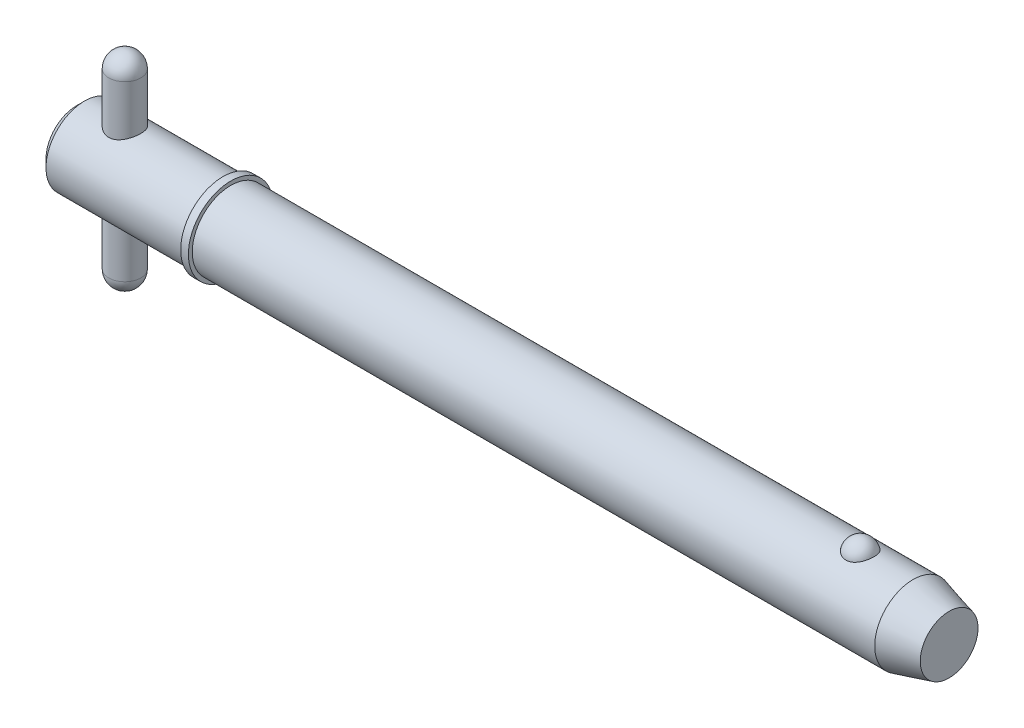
ISO-10303-21;
HEADER;
FILE_DESCRIPTION(('STEP AP214'),'2;1');
FILE_NAME('part.step','',(''),(''),'','','');
FILE_SCHEMA(('AUTOMOTIVE_DESIGN { 1 0 10303 214 1 1 1 1 }'));
ENDSEC;
DATA;
#1=APPLICATION_CONTEXT('core data for automotive mechanical design processes');
#2=APPLICATION_PROTOCOL_DEFINITION('international standard','automotive_design',2000,#1);
#3=PRODUCT_CONTEXT('',#1,'mechanical');
#4=PRODUCT('Part','Part','',(#3));
#5=PRODUCT_RELATED_PRODUCT_CATEGORY('part','',(#4));
#6=PRODUCT_DEFINITION_FORMATION('','',#4);
#7=PRODUCT_DEFINITION_CONTEXT('part definition',#1,'design');
#8=PRODUCT_DEFINITION('design','',#6,#7);
#9=PRODUCT_DEFINITION_SHAPE('','',#8);
#10=(LENGTH_UNIT() NAMED_UNIT(*) SI_UNIT(.MILLI.,.METRE.));
#11=(NAMED_UNIT(*) PLANE_ANGLE_UNIT() SI_UNIT($,.RADIAN.));
#12=(NAMED_UNIT(*) SI_UNIT($,.STERADIAN.) SOLID_ANGLE_UNIT());
#13=UNCERTAINTY_MEASURE_WITH_UNIT(LENGTH_MEASURE(1.E-05),#10,'distance_accuracy_value','');
#14=(GEOMETRIC_REPRESENTATION_CONTEXT(3) GLOBAL_UNCERTAINTY_ASSIGNED_CONTEXT((#13)) GLOBAL_UNIT_ASSIGNED_CONTEXT((#10,
#11,#12)) REPRESENTATION_CONTEXT('',''));
#15=CARTESIAN_POINT('',(0.,0.,0.));
#16=DIRECTION('',(0.,0.,1.));
#17=DIRECTION('',(1.,0.,0.));
#18=AXIS2_PLACEMENT_3D('',#15,#16,#17);
#19=CARTESIAN_POINT('',(5.94,12.7,0.));
#20=DIRECTION('',(0.,-1.,0.));
#21=DIRECTION('',(0.,0.,-1.));
#22=AXIS2_PLACEMENT_3D('',#19,#20,#21);
#23=CYLINDRICAL_SURFACE('',#22,1.98);
#24=CARTESIAN_POINT('',(5.94,-10.72,0.));
#25=DIRECTION('',(0.,-1.,0.));
#26=DIRECTION('',(0.,0.,-1.));
#27=AXIS2_PLACEMENT_3D('',#24,#25,#26);
#28=CIRCLE('',#27,1.98);
#29=CARTESIAN_POINT('',(5.94,-10.72,-1.98));
#30=VERTEX_POINT('',#29);
#31=EDGE_CURVE('P0_E10',#30,#30,#28,.F.);
#32=ORIENTED_EDGE('',*,*,#31,.T.);
#33=EDGE_LOOP('',(#32));
#34=FACE_BOUND('',#33,.T.);
#35=CARTESIAN_POINT('',(5.94,10.72,0.));
#36=DIRECTION('',(0.,-1.,0.));
#37=DIRECTION('',(0.,0.,-1.));
#38=AXIS2_PLACEMENT_3D('',#35,#36,#37);
#39=CIRCLE('',#38,1.98);
#40=CARTESIAN_POINT('',(5.94,10.72,-1.98));
#41=VERTEX_POINT('',#40);
#42=EDGE_CURVE('P0_E21',#41,#41,#39,.T.);
#43=ORIENTED_EDGE('',*,*,#42,.T.);
#44=EDGE_LOOP('',(#43));
#45=FACE_BOUND('',#44,.T.);
#46=ADVANCED_FACE('P0_F14',(#34,#45),#23,.T.);
#47=CARTESIAN_POINT('',(5.94,-10.72,0.));
#48=DIRECTION('',(0.,0.,1.));
#49=DIRECTION('',(1.,0.,0.));
#50=AXIS2_PLACEMENT_3D('',#47,#48,#49);
#51=SPHERICAL_SURFACE('',#50,1.98);
#52=CARTESIAN_POINT('',(5.94,-10.72,0.));
#53=DIRECTION('',(0.,-1.,0.));
#54=DIRECTION('',(0.,0.,-1.));
#55=AXIS2_PLACEMENT_3D('',#52,#53,#54);
#56=SPHERICAL_SURFACE('',#55,1.98);
#57=ORIENTED_EDGE('',*,*,#31,.F.);
#58=EDGE_LOOP('',(#57));
#59=FACE_BOUND('',#58,.T.);
#60=ADVANCED_FACE('P0_F29',(#59),#56,.T.);
#61=CARTESIAN_POINT('',(5.94,10.72,0.));
#62=DIRECTION('',(0.,0.,1.));
#63=DIRECTION('',(1.,0.,0.));
#64=AXIS2_PLACEMENT_3D('',#61,#62,#63);
#65=SPHERICAL_SURFACE('',#64,1.98);
#66=CARTESIAN_POINT('',(5.94,10.72,0.));
#67=DIRECTION('',(0.,-1.,0.));
#68=DIRECTION('',(0.,0.,-1.));
#69=AXIS2_PLACEMENT_3D('',#66,#67,#68);
#70=SPHERICAL_SURFACE('',#69,1.98);
#71=ORIENTED_EDGE('',*,*,#42,.F.);
#72=EDGE_LOOP('',(#71));
#73=FACE_BOUND('',#72,.T.);
#74=ADVANCED_FACE('P0_F16',(#73),#70,.T.);
#75=CLOSED_SHELL('',(#46,#60,#74));
#76=MANIFOLD_SOLID_BREP('P0_B1',#75);
#77=CARTESIAN_POINT('',(0.,0.,0.));
#78=DIRECTION('',(1.,0.,0.));
#79=DIRECTION('',(0.,0.,-1.));
#80=AXIS2_PLACEMENT_3D('',#77,#78,#79);
#81=CYLINDRICAL_SURFACE('',#80,4.765);
#82=CARTESIAN_POINT('',(103.504194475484,0.,0.));
#83=DIRECTION('',(1.,0.,0.));
#84=DIRECTION('',(0.,0.,-1.));
#85=AXIS2_PLACEMENT_3D('',#82,#83,#84);
#86=CIRCLE('',#85,4.765);
#87=CARTESIAN_POINT('',(103.504194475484,0.,-4.765));
#88=VERTEX_POINT('',#87);
#89=EDGE_CURVE('P1_E81',#88,#88,#86,.T.);
#90=ORIENTED_EDGE('',*,*,#89,.F.);
#91=EDGE_LOOP('',(#90));
#92=FACE_BOUND('',#91,.T.);
#93=CARTESIAN_POINT('',(19.05,0.,0.));
#94=DIRECTION('',(1.,0.,0.));
#95=DIRECTION('',(0.,0.,-1.));
#96=AXIS2_PLACEMENT_3D('',#93,#94,#95);
#97=CIRCLE('',#96,4.765);
#98=CARTESIAN_POINT('',(19.05,0.,-4.765));
#99=VERTEX_POINT('',#98);
#100=EDGE_CURVE('P1_E85',#99,#99,#97,.T.);
#101=ORIENTED_EDGE('',*,*,#100,.T.);
#102=EDGE_LOOP('',(#101));
#103=FACE_BOUND('',#102,.T.);
#104=CARTESIAN_POINT('',(96.951020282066,4.42764777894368,1.76101111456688));
#105=CARTESIAN_POINT('',(96.8597212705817,4.42764470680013,1.76101422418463));
#106=CARTESIAN_POINT('',(96.7684468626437,4.43059091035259,1.75366340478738));
#107=CARTESIAN_POINT('',(96.5886154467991,4.44201846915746,1.72451180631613));
#108=CARTESIAN_POINT('',(96.5000577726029,4.45049845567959,1.70271460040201));
#109=CARTESIAN_POINT('',(96.3282570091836,4.47200516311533,1.6453937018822));
#110=CARTESIAN_POINT('',(96.2450064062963,4.48502527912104,1.60988994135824));
#111=CARTESIAN_POINT('',(96.0857633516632,4.51419542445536,1.52617873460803));
#112=CARTESIAN_POINT('',(96.0097723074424,4.53034605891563,1.47796883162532));
#113=CARTESIAN_POINT('',(95.8647445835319,4.5645931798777,1.36860494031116));
#114=CARTESIAN_POINT('',(95.7959645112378,4.58273170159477,1.30712420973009));
#115=CARTESIAN_POINT('',(95.6693423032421,4.61870302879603,1.1737020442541));
#116=CARTESIAN_POINT('',(95.6115021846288,4.63653577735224,1.1017586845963));
#117=CARTESIAN_POINT('',(95.5055709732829,4.67090140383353,0.945806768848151));
#118=CARTESIAN_POINT('',(95.4580305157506,4.68734068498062,0.861402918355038));
#119=CARTESIAN_POINT('',(95.3770817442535,4.71628466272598,0.685442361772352));
#120=CARTESIAN_POINT('',(95.3436747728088,4.72878898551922,0.59388497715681));
#121=CARTESIAN_POINT('',(95.291287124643,4.74874061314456,0.404781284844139));
#122=CARTESIAN_POINT('',(95.2725178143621,4.75611366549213,0.30716844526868));
#123=CARTESIAN_POINT('',(95.2505846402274,4.76475393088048,0.109940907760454));
#124=CARTESIAN_POINT('',(95.2474205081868,4.76602124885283,0.0103262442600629));
#125=CARTESIAN_POINT('',(95.2567405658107,4.76232928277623,-0.187629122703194));
#126=CARTESIAN_POINT('',(95.2691588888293,4.7573962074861,-0.28597342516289));
#127=CARTESIAN_POINT('',(95.3092804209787,4.74184975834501,-0.479027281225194));
#128=CARTESIAN_POINT('',(95.3369839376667,4.7312362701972,-0.573736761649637));
#129=CARTESIAN_POINT('',(95.4071581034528,4.70540026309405,-0.756973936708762));
#130=CARTESIAN_POINT('',(95.4496460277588,4.69017235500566,-0.845494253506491));
#131=CARTESIAN_POINT('',(95.548520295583,4.6566986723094,-1.01378033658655));
#132=CARTESIAN_POINT('',(95.6049076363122,4.63845268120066,-1.09354547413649));
#133=CARTESIAN_POINT('',(95.730552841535,4.60085438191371,-1.24228523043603));
#134=CARTESIAN_POINT('',(95.7998439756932,4.58149930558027,-1.31123108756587));
#135=CARTESIAN_POINT('',(95.9496066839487,4.54391653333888,-1.43607409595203));
#136=CARTESIAN_POINT('',(96.0300771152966,4.52568872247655,-1.49197257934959));
#137=CARTESIAN_POINT('',(96.1981500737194,4.49293007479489,-1.58786764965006));
#138=CARTESIAN_POINT('',(96.2855445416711,4.47832346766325,-1.62820219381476));
#139=CARTESIAN_POINT('',(96.466553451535,4.45406011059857,-1.69345757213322));
#140=CARTESIAN_POINT('',(96.5601655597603,4.44440151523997,-1.71838415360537));
#141=CARTESIAN_POINT('',(96.7458939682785,4.43159888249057,-1.75112843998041));
#142=CARTESIAN_POINT('',(96.837849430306,4.42815213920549,-1.75974223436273));
#143=CARTESIAN_POINT('',(97.0219658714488,4.427247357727,-1.76201865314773));
#144=CARTESIAN_POINT('',(97.1141268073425,4.42978816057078,-1.7556841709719));
#145=CARTESIAN_POINT('',(97.2931292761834,4.4403864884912,-1.72869560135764));
#146=CARTESIAN_POINT('',(97.3800474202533,4.44827555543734,-1.70847853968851));
#147=CARTESIAN_POINT('',(97.5491314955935,4.46852246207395,-1.65479562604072));
#148=CARTESIAN_POINT('',(97.6312970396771,4.48088066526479,-1.62132869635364));
#149=CARTESIAN_POINT('',(97.7905916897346,4.50907357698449,-1.54120560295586));
#150=CARTESIAN_POINT('',(97.8675700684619,4.52497884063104,-1.49427526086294));
#151=CARTESIAN_POINT('',(98.0127080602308,4.55845148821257,-1.38881222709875));
#152=CARTESIAN_POINT('',(98.0808656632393,4.57601924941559,-1.33027689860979));
#153=CARTESIAN_POINT('',(98.2100990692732,4.61196537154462,-1.19991049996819));
#154=CARTESIAN_POINT('',(98.2706562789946,4.63034074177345,-1.12756415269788));
#155=CARTESIAN_POINT('',(98.3792797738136,4.66513959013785,-0.973612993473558));
#156=CARTESIAN_POINT('',(98.4273438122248,4.68156271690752,-0.892006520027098));
#157=CARTESIAN_POINT('',(98.511383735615,4.71130224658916,-0.718892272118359));
#158=CARTESIAN_POINT('',(98.5469185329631,4.724501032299,-0.627149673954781));
#159=CARTESIAN_POINT('',(98.6029522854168,4.74571823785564,-0.438611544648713));
#160=CARTESIAN_POINT('',(98.623450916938,4.75373654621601,-0.341815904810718));
#161=CARTESIAN_POINT('',(98.6490338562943,4.76378905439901,-0.145633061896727));
#162=CARTESIAN_POINT('',(98.654076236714,4.76580697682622,-0.0462395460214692));
#163=CARTESIAN_POINT('',(98.6485239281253,4.7636057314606,0.152038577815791));
#164=CARTESIAN_POINT('',(98.6379294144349,4.75938663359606,0.250923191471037));
#165=CARTESIAN_POINT('',(98.6013875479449,4.74516937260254,0.445004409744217));
#166=CARTESIAN_POINT('',(98.5754964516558,4.73519238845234,0.540213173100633));
#167=CARTESIAN_POINT('',(98.5089273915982,4.7104939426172,0.724662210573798));
#168=CARTESIAN_POINT('',(98.468248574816,4.69577220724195,0.813902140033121));
#169=CARTESIAN_POINT('',(98.3727177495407,4.66303767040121,0.984313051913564));
#170=CARTESIAN_POINT('',(98.3178042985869,4.64501070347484,1.06544688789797));
#171=CARTESIAN_POINT('',(98.1950496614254,4.60764678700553,1.21692673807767));
#172=CARTESIAN_POINT('',(98.1272086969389,4.58830985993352,1.2872729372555));
#173=CARTESIAN_POINT('',(97.9805480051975,4.55060370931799,1.41479271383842));
#174=CARTESIAN_POINT('',(97.9017918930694,4.53222967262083,1.47203785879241));
#175=CARTESIAN_POINT('',(97.7349890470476,4.49849576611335,1.57212016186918));
#176=CARTESIAN_POINT('',(97.6469417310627,4.48313608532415,1.61495641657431));
#177=CARTESIAN_POINT('',(97.4597918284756,4.45676184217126,1.68642657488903));
#178=CARTESIAN_POINT('',(97.3603653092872,4.44598302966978,1.71430590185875));
#179=CARTESIAN_POINT('',(97.1576210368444,4.43142918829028,1.75159258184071));
#180=CARTESIAN_POINT('',(97.0543049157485,4.42765125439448,1.76100759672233));
#181=CARTESIAN_POINT('',(96.951020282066,4.42764777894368,1.76101111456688));
#182=B_SPLINE_CURVE_WITH_KNOTS('',3,(#104,#105,#106,#107,#108,#109,#110,#111,#112,#113,#114,
#115,#116,#117,#118,#119,#120,#121,#122,#123,#124,#125,#126,#127,#128,#129,#130,#131,#132,#133,
#134,#135,#136,#137,#138,#139,#140,#141,#142,#143,#144,#145,#146,#147,#148,#149,#150,#151,#152,
#153,#154,#155,#156,#157,#158,#159,#160,#161,#162,#163,#164,#165,#166,#167,#168,#169,#170,#171,
#172,#173,#174,#175,#176,#177,#178,#179,#180,#181),.UNSPECIFIED.,.T.,.F.,(4,2,2,2,2,2,2,2,2,2,2,
2,2,2,2,2,2,2,2,2,2,2,2,2,2,2,2,2,2,2,2,2,2,2,2,2,2,2,4),(0.,0.273517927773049,
0.546968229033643,0.820022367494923,1.09312934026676,1.37393946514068,1.65480131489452,
1.94820420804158,2.24163496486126,2.53922817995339,2.8368162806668,3.13315071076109,
3.42949110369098,3.72617893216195,4.02288805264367,4.32037303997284,4.61782764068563,
4.9084009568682,5.19886582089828,5.4747485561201,5.75057789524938,6.01809977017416,
6.2856434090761,6.55907787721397,6.83257454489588,7.11962987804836,7.40673679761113,
7.70312663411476,7.99952284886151,8.29672237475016,8.59391856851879,8.89002850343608,
9.18615552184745,9.483582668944,9.78100471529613,10.0767610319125,10.3725358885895,
10.6820893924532,10.991514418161),.UNSPECIFIED.);
#183=CARTESIAN_POINT('',(96.951020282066,4.42764777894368,1.76101111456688));
#184=VERTEX_POINT('',#183);
#185=EDGE_CURVE('P1_E35',#184,#184,#182,.T.);
#186=ORIENTED_EDGE('',*,*,#185,.T.);
#187=EDGE_LOOP('',(#186));
#188=FACE_BOUND('',#187,.T.);
#189=ADVANCED_FACE('P1_F13',(#92,#103,#188),#81,.T.);
#190=CARTESIAN_POINT('',(0.,0.,0.));
#191=DIRECTION('',(-1.,0.,0.));
#192=DIRECTION('',(0.,0.,1.));
#193=AXIS2_PLACEMENT_3D('',#190,#191,#192);
#194=PLANE('',#193);
#195=CARTESIAN_POINT('',(0.,0.,0.));
#196=DIRECTION('',(1.,0.,0.));
#197=DIRECTION('',(0.,0.,-1.));
#198=AXIS2_PLACEMENT_3D('',#195,#196,#197);
#199=CIRCLE('',#198,3.812);
#200=CARTESIAN_POINT('',(0.,0.,-3.812));
#201=VERTEX_POINT('',#200);
#202=EDGE_CURVE('P1_E9',#201,#201,#199,.T.);
#203=ORIENTED_EDGE('',*,*,#202,.F.);
#204=EDGE_LOOP('',(#203));
#205=FACE_BOUND('',#204,.T.);
#206=ADVANCED_FACE('P1_F15',(#205),#194,.T.);
#207=CARTESIAN_POINT('',(0.952999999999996,0.,0.));
#208=DIRECTION('',(1.,0.,0.));
#209=DIRECTION('',(0.,0.,-1.));
#210=AXIS2_PLACEMENT_3D('',#207,#208,#209);
#211=CONICAL_SURFACE('',#210,4.765,0.78539816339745);
#212=ORIENTED_EDGE('',*,*,#202,.T.);
#213=EDGE_LOOP('',(#212));
#214=FACE_BOUND('',#213,.T.);
#215=CARTESIAN_POINT('',(0.952999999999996,0.,0.));
#216=DIRECTION('',(1.,0.,0.));
#217=DIRECTION('',(0.,0.,-1.));
#218=AXIS2_PLACEMENT_3D('',#215,#216,#217);
#219=CIRCLE('',#218,4.765);
#220=CARTESIAN_POINT('',(0.952999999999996,0.,-4.765));
#221=VERTEX_POINT('',#220);
#222=EDGE_CURVE('P1_E26',#221,#221,#219,.T.);
#223=ORIENTED_EDGE('',*,*,#222,.F.);
#224=EDGE_LOOP('',(#223));
#225=FACE_BOUND('',#224,.T.);
#226=ADVANCED_FACE('P1_F77',(#214,#225),#211,.T.);
#227=CARTESIAN_POINT('',(0.,0.,0.));
#228=DIRECTION('',(1.,0.,0.));
#229=DIRECTION('',(0.,0.,-1.));
#230=AXIS2_PLACEMENT_3D('',#227,#228,#229);
#231=CYLINDRICAL_SURFACE('',#230,4.765);
#232=CARTESIAN_POINT('',(5.94,-4.33414639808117,1.98));
#233=CARTESIAN_POINT('',(5.83435484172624,-4.33415447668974,1.97999169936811));
#234=CARTESIAN_POINT('',(5.72854887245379,-4.33806396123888,1.97149330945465));
#235=CARTESIAN_POINT('',(5.51998191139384,-4.35319906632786,1.93783487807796));
#236=CARTESIAN_POINT('',(5.41723000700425,-4.3644446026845,1.91262947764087));
#237=CARTESIAN_POINT('',(5.21817294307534,-4.39274225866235,1.84670269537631));
#238=CARTESIAN_POINT('',(5.12184344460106,-4.40977076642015,1.80604432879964));
#239=CARTESIAN_POINT('',(4.93740039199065,-4.44768106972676,1.71055160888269));
#240=CARTESIAN_POINT('',(4.84928487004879,-4.46856193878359,1.65572066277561));
#241=CARTESIAN_POINT('',(4.67826533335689,-4.51326966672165,1.52981120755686));
#242=CARTESIAN_POINT('',(4.59593118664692,-4.53719608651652,1.45799365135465));
#243=CARTESIAN_POINT('',(4.44405452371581,-4.58448035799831,1.30170177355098));
#244=CARTESIAN_POINT('',(4.37451692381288,-4.60783798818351,1.21722260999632));
#245=CARTESIAN_POINT('',(4.24730683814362,-4.65256187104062,1.03353484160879));
#246=CARTESIAN_POINT('',(4.19027484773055,-4.67379892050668,0.933848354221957));
#247=CARTESIAN_POINT('',(4.0940363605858,-4.7106711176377,0.7252544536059));
#248=CARTESIAN_POINT('',(4.05482199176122,-4.72630873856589,0.61635113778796));
#249=CARTESIAN_POINT('',(3.99739515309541,-4.74951416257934,0.398397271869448));
#250=CARTESIAN_POINT('',(3.97820018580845,-4.7574579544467,0.289646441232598));
#251=CARTESIAN_POINT('',(3.95818309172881,-4.76574596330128,0.0701967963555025));
#252=CARTESIAN_POINT('',(3.95735355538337,-4.76609324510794,-0.0405012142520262));
#253=CARTESIAN_POINT('',(3.9735743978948,-4.75937098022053,-0.253561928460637));
#254=CARTESIAN_POINT('',(3.98954548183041,-4.75274912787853,-0.356023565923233));
#255=CARTESIAN_POINT('',(4.03706504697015,-4.73344665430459,-0.556659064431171));
#256=CARTESIAN_POINT('',(4.06861467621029,-4.72076558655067,-0.654832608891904));
#257=CARTESIAN_POINT('',(4.14677192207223,-4.69032846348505,-0.845904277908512));
#258=CARTESIAN_POINT('',(4.19360181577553,-4.67249797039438,-0.938699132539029));
#259=CARTESIAN_POINT('',(4.30077315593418,-4.63350852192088,-1.11535616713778));
#260=CARTESIAN_POINT('',(4.3611193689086,-4.61234839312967,-1.19921518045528));
#261=CARTESIAN_POINT('',(4.49853487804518,-4.56707259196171,-1.3618711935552));
#262=CARTESIAN_POINT('',(4.57648039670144,-4.5428537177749,-1.43990029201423));
#263=CARTESIAN_POINT('',(4.74440779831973,-4.49530722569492,-1.58211009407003));
#264=CARTESIAN_POINT('',(4.83439425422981,-4.47197995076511,-1.64628551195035));
#265=CARTESIAN_POINT('',(5.02755026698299,-4.42812342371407,-1.76092221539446));
#266=CARTESIAN_POINT('',(5.13105348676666,-4.40770990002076,-1.81086937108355));
#267=CARTESIAN_POINT('',(5.34607555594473,-4.37336901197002,-1.89231211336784));
#268=CARTESIAN_POINT('',(5.45758864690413,-4.3594370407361,-1.92382080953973));
#269=CARTESIAN_POINT('',(5.67777275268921,-4.34077746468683,-1.96554536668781));
#270=CARTESIAN_POINT('',(5.78616167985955,-4.33551319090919,-1.9770057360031));
#271=CARTESIAN_POINT('',(6.00341835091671,-4.33325118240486,-1.98196183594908));
#272=CARTESIAN_POINT('',(6.11228591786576,-4.33625061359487,-1.97546372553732));
#273=CARTESIAN_POINT('',(6.32012423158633,-4.34962383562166,-1.94582288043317));
#274=CARTESIAN_POINT('',(6.41928436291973,-4.35951709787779,-1.92376364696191));
#275=CARTESIAN_POINT('',(6.61241543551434,-4.38495043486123,-1.86506038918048));
#276=CARTESIAN_POINT('',(6.70638516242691,-4.40049182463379,-1.82841296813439));
#277=CARTESIAN_POINT('',(6.89090272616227,-4.43627016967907,-1.73985559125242));
#278=CARTESIAN_POINT('',(6.98113841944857,-4.45667771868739,-1.68736639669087));
#279=CARTESIAN_POINT('',(7.1519532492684,-4.49964530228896,-1.56919282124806));
#280=CARTESIAN_POINT('',(7.232528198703,-4.52220626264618,-1.50350275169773));
#281=CARTESIAN_POINT('',(7.38851617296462,-4.56914071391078,-1.35452895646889));
#282=CARTESIAN_POINT('',(7.46298462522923,-4.5935132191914,-1.27025197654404));
#283=CARTESIAN_POINT('',(7.59689029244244,-4.63962841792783,-1.08983181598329));
#284=CARTESIAN_POINT('',(7.65632644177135,-4.66137092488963,-0.993687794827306));
#285=CARTESIAN_POINT('',(7.75840361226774,-4.69991192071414,-0.791608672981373));
#286=CARTESIAN_POINT('',(7.80100481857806,-4.71669866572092,-0.685651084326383));
#287=CARTESIAN_POINT('',(7.86746997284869,-4.74331408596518,-0.467197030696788));
#288=CARTESIAN_POINT('',(7.8913450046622,-4.75314687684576,-0.354704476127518));
#289=CARTESIAN_POINT('',(7.91828971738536,-4.76427543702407,-0.134819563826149));
#290=CARTESIAN_POINT('',(7.92269147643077,-4.76611762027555,-0.027616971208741));
#291=CARTESIAN_POINT('',(7.91414154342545,-4.76256684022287,0.185959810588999));
#292=CARTESIAN_POINT('',(7.90119286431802,-4.75717513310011,0.292334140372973));
#293=CARTESIAN_POINT('',(7.85926572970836,-4.74004856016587,0.497383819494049));
#294=CARTESIAN_POINT('',(7.83086647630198,-4.72854322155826,0.596198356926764));
#295=CARTESIAN_POINT('',(7.75947503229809,-4.70045111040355,0.787624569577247));
#296=CARTESIAN_POINT('',(7.71648006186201,-4.68386336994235,0.880235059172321));
#297=CARTESIAN_POINT('',(7.6149456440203,-4.64628321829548,1.06122875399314));
#298=CARTESIAN_POINT('',(7.55579211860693,-4.62512577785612,1.14923242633));
#299=CARTESIAN_POINT('',(7.42451813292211,-4.58091700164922,1.31443888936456));
#300=CARTESIAN_POINT('',(7.35239289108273,-4.5578649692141,1.39163767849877));
#301=CARTESIAN_POINT('',(7.19146107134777,-4.51050832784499,1.53847013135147));
#302=CARTESIAN_POINT('',(7.10185635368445,-4.48622440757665,1.60723941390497));
#303=CARTESIAN_POINT('',(6.91164948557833,-4.44076541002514,1.72888900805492));
#304=CARTESIAN_POINT('',(6.81104124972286,-4.41959206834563,1.78176046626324));
#305=CARTESIAN_POINT('',(6.60181953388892,-4.38318936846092,1.86953227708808));
#306=CARTESIAN_POINT('',(6.49325511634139,-4.3679267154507,1.90453365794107));
#307=CARTESIAN_POINT('',(6.32681512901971,-4.35102038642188,1.94268459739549));
#308=CARTESIAN_POINT('',(6.27079191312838,-4.34638447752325,1.953006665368));
#309=CARTESIAN_POINT('',(6.15793999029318,-4.33925923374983,1.96879053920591));
#310=CARTESIAN_POINT('',(6.10111188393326,-4.33676837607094,1.97425579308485));
#311=CARTESIAN_POINT('',(6.00947316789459,-4.33456308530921,1.97908711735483));
#312=CARTESIAN_POINT('',(5.97474528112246,-4.33414374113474,1.98000272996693));
#313=CARTESIAN_POINT('',(5.94,-4.33414639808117,1.98));
#314=B_SPLINE_CURVE_WITH_KNOTS('',3,(#232,#233,#234,#235,#236,#237,#238,#239,#240,#241,#242,
#243,#244,#245,#246,#247,#248,#249,#250,#251,#252,#253,#254,#255,#256,#257,#258,#259,#260,#261,
#262,#263,#264,#265,#266,#267,#268,#269,#270,#271,#272,#273,#274,#275,#276,#277,#278,#279,#280,
#281,#282,#283,#284,#285,#286,#287,#288,#289,#290,#291,#292,#293,#294,#295,#296,#297,#298,#299,
#300,#301,#302,#303,#304,#305,#306,#307,#308,#309,#310,#311,#312,#313),.UNSPECIFIED.,.T.,.F.,(4,
2,2,2,2,2,2,2,2,2,2,2,2,2,2,2,2,2,2,2,2,2,2,2,2,2,2,2,2,2,2,2,2,2,2,2,2,2,2,2,4),(0.,
0.316814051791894,0.634491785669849,0.950887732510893,1.2672076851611,1.60127705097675,
1.93547449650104,2.28407463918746,2.63252061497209,2.96292077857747,3.29318763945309,
3.60346227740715,3.91375978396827,4.22878888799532,4.54392926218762,4.88117914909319,
5.21855748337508,5.56691259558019,5.91501972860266,6.24062939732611,6.56612741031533,
6.87094948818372,7.17584258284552,7.49361276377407,7.81152017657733,8.15513975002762,
8.4987836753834,8.8432355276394,9.18748334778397,9.50777781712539,9.8280166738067,
10.1370037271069,10.4460496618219,10.7690461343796,11.0921619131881,11.4371238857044,
11.7822776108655,12.1254577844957,12.2967183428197,12.4678572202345,12.5720531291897),.UNSPECIFIED.);
#315=CARTESIAN_POINT('',(5.94,-4.33414639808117,1.98));
#316=VERTEX_POINT('',#315);
#317=EDGE_CURVE('P1_E17',#316,#316,#314,.T.);
#318=ORIENTED_EDGE('',*,*,#317,.F.);
#319=EDGE_LOOP('',(#318));
#320=FACE_BOUND('',#319,.T.);
#321=CARTESIAN_POINT('',(5.94,4.33414639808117,1.98));
#322=CARTESIAN_POINT('',(6.04564515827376,4.33415447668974,1.97999169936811));
#323=CARTESIAN_POINT('',(6.15145112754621,4.33806396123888,1.97149330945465));
#324=CARTESIAN_POINT('',(6.36001808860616,4.35319906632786,1.93783487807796));
#325=CARTESIAN_POINT('',(6.46276999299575,4.3644446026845,1.91262947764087));
#326=CARTESIAN_POINT('',(6.66182705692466,4.39274225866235,1.84670269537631));
#327=CARTESIAN_POINT('',(6.75815655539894,4.40977076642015,1.80604432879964));
#328=CARTESIAN_POINT('',(6.94259960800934,4.44768106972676,1.71055160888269));
#329=CARTESIAN_POINT('',(7.03071512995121,4.46856193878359,1.65572066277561));
#330=CARTESIAN_POINT('',(7.20173466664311,4.51326966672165,1.52981120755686));
#331=CARTESIAN_POINT('',(7.28406881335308,4.53719608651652,1.45799365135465));
#332=CARTESIAN_POINT('',(7.43594547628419,4.58448035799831,1.30170177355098));
#333=CARTESIAN_POINT('',(7.50548307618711,4.60783798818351,1.21722260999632));
#334=CARTESIAN_POINT('',(7.63269316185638,4.65256187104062,1.03353484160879));
#335=CARTESIAN_POINT('',(7.68972515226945,4.67379892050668,0.933848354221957));
#336=CARTESIAN_POINT('',(7.7859636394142,4.7106711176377,0.7252544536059));
#337=CARTESIAN_POINT('',(7.82517800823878,4.72630873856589,0.61635113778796));
#338=CARTESIAN_POINT('',(7.88260484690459,4.74951416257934,0.398397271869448));
#339=CARTESIAN_POINT('',(7.90179981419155,4.7574579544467,0.289646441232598));
#340=CARTESIAN_POINT('',(7.92181690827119,4.76574596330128,0.0701967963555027));
#341=CARTESIAN_POINT('',(7.92264644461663,4.76609324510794,-0.040501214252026));
#342=CARTESIAN_POINT('',(7.9064256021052,4.75937098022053,-0.253561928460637));
#343=CARTESIAN_POINT('',(7.89045451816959,4.75274912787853,-0.356023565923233));
#344=CARTESIAN_POINT('',(7.84293495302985,4.73344665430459,-0.55665906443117));
#345=CARTESIAN_POINT('',(7.81138532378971,4.72076558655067,-0.654832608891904));
#346=CARTESIAN_POINT('',(7.73322807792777,4.69032846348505,-0.845904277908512));
#347=CARTESIAN_POINT('',(7.68639818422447,4.67249797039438,-0.938699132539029));
#348=CARTESIAN_POINT('',(7.57922684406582,4.63350852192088,-1.11535616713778));
#349=CARTESIAN_POINT('',(7.5188806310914,4.61234839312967,-1.19921518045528));
#350=CARTESIAN_POINT('',(7.38146512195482,4.56707259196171,-1.3618711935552));
#351=CARTESIAN_POINT('',(7.30351960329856,4.5428537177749,-1.43990029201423));
#352=CARTESIAN_POINT('',(7.13559220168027,4.49530722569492,-1.58211009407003));
#353=CARTESIAN_POINT('',(7.04560574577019,4.47197995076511,-1.64628551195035));
#354=CARTESIAN_POINT('',(6.85244973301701,4.42812342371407,-1.76092221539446));
#355=CARTESIAN_POINT('',(6.74894651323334,4.40770990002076,-1.81086937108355));
#356=CARTESIAN_POINT('',(6.53392444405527,4.37336901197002,-1.89231211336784));
#357=CARTESIAN_POINT('',(6.42241135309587,4.3594370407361,-1.92382080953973));
#358=CARTESIAN_POINT('',(6.20222724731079,4.34077746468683,-1.96554536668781));
#359=CARTESIAN_POINT('',(6.09383832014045,4.33551319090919,-1.9770057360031));
#360=CARTESIAN_POINT('',(5.87658164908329,4.33325118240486,-1.98196183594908));
#361=CARTESIAN_POINT('',(5.76771408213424,4.33625061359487,-1.97546372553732));
#362=CARTESIAN_POINT('',(5.55987576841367,4.34962383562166,-1.94582288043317));
#363=CARTESIAN_POINT('',(5.46071563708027,4.35951709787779,-1.92376364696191));
#364=CARTESIAN_POINT('',(5.26758456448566,4.38495043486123,-1.86506038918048));
#365=CARTESIAN_POINT('',(5.17361483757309,4.40049182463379,-1.82841296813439));
#366=CARTESIAN_POINT('',(4.98909727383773,4.43627016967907,-1.73985559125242));
#367=CARTESIAN_POINT('',(4.89886158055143,4.45667771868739,-1.68736639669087));
#368=CARTESIAN_POINT('',(4.72804675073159,4.49964530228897,-1.56919282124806));
#369=CARTESIAN_POINT('',(4.647471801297,4.52220626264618,-1.50350275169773));
#370=CARTESIAN_POINT('',(4.49148382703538,4.56914071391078,-1.35452895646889));
#371=CARTESIAN_POINT('',(4.41701537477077,4.5935132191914,-1.27025197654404));
#372=CARTESIAN_POINT('',(4.28310970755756,4.63962841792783,-1.08983181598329));
#373=CARTESIAN_POINT('',(4.22367355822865,4.66137092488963,-0.993687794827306));
#374=CARTESIAN_POINT('',(4.12159638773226,4.69991192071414,-0.791608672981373));
#375=CARTESIAN_POINT('',(4.07899518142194,4.71669866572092,-0.685651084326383));
#376=CARTESIAN_POINT('',(4.01253002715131,4.74331408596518,-0.467197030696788));
#377=CARTESIAN_POINT('',(3.98865499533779,4.75314687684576,-0.354704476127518));
#378=CARTESIAN_POINT('',(3.96171028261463,4.76427543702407,-0.134819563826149));
#379=CARTESIAN_POINT('',(3.95730852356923,4.76611762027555,-0.0276169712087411));
#380=CARTESIAN_POINT('',(3.96585845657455,4.76256684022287,0.185959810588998));
#381=CARTESIAN_POINT('',(3.97880713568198,4.75717513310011,0.292334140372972));
#382=CARTESIAN_POINT('',(4.02073427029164,4.74004856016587,0.497383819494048));
#383=CARTESIAN_POINT('',(4.04913352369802,4.72854322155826,0.596198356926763));
#384=CARTESIAN_POINT('',(4.12052496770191,4.70045111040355,0.787624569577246));
#385=CARTESIAN_POINT('',(4.16351993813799,4.68386336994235,0.880235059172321));
#386=CARTESIAN_POINT('',(4.2650543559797,4.64628321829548,1.06122875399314));
#387=CARTESIAN_POINT('',(4.32420788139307,4.62512577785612,1.14923242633));
#388=CARTESIAN_POINT('',(4.45548186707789,4.58091700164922,1.31443888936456));
#389=CARTESIAN_POINT('',(4.52760710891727,4.5578649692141,1.39163767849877));
#390=CARTESIAN_POINT('',(4.68853892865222,4.51050832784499,1.53847013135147));
#391=CARTESIAN_POINT('',(4.77814364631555,4.48622440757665,1.60723941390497));
#392=CARTESIAN_POINT('',(4.96835051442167,4.44076541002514,1.72888900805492));
#393=CARTESIAN_POINT('',(5.06895875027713,4.41959206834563,1.78176046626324));
#394=CARTESIAN_POINT('',(5.27818046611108,4.38318936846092,1.86953227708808));
#395=CARTESIAN_POINT('',(5.38674488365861,4.3679267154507,1.90453365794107));
#396=CARTESIAN_POINT('',(5.55318487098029,4.35102038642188,1.94268459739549));
#397=CARTESIAN_POINT('',(5.60920808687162,4.34638447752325,1.953006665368));
#398=CARTESIAN_POINT('',(5.72206000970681,4.33925923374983,1.96879053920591));
#399=CARTESIAN_POINT('',(5.77888811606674,4.33676837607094,1.97425579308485));
#400=CARTESIAN_POINT('',(5.87052683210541,4.33456308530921,1.97908711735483));
#401=CARTESIAN_POINT('',(5.90525471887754,4.33414374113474,1.98000272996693));
#402=CARTESIAN_POINT('',(5.94,4.33414639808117,1.98));
#403=B_SPLINE_CURVE_WITH_KNOTS('',3,(#321,#322,#323,#324,#325,#326,#327,#328,#329,#330,#331,
#332,#333,#334,#335,#336,#337,#338,#339,#340,#341,#342,#343,#344,#345,#346,#347,#348,#349,#350,
#351,#352,#353,#354,#355,#356,#357,#358,#359,#360,#361,#362,#363,#364,#365,#366,#367,#368,#369,
#370,#371,#372,#373,#374,#375,#376,#377,#378,#379,#380,#381,#382,#383,#384,#385,#386,#387,#388,
#389,#390,#391,#392,#393,#394,#395,#396,#397,#398,#399,#400,#401,#402),.UNSPECIFIED.,.T.,.F.,(4,
2,2,2,2,2,2,2,2,2,2,2,2,2,2,2,2,2,2,2,2,2,2,2,2,2,2,2,2,2,2,2,2,2,2,2,2,2,2,2,4),(0.,
0.316814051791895,0.634491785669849,0.950887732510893,1.2672076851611,1.60127705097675,
1.93547449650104,2.28407463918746,2.63252061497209,2.96292077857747,3.29318763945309,
3.60346227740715,3.91375978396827,4.22878888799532,4.54392926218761,4.88117914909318,
5.21855748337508,5.56691259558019,5.91501972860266,6.24062939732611,6.56612741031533,
6.87094948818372,7.17584258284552,7.49361276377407,7.81152017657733,8.15513975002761,
8.4987836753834,8.84323552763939,9.18748334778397,9.50777781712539,9.8280166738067,
10.1370037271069,10.4460496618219,10.7690461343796,11.0921619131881,11.4371238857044,
11.7822776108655,12.1254577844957,12.2967183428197,12.4678572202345,12.5720531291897),.UNSPECIFIED.);
#404=CARTESIAN_POINT('',(5.94,4.33414639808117,1.98));
#405=VERTEX_POINT('',#404);
#406=EDGE_CURVE('P1_E43',#405,#405,#403,.T.);
#407=ORIENTED_EDGE('',*,*,#406,.F.);
#408=EDGE_LOOP('',(#407));
#409=FACE_BOUND('',#408,.T.);
#410=ORIENTED_EDGE('',*,*,#222,.T.);
#411=EDGE_LOOP('',(#410));
#412=FACE_BOUND('',#411,.T.);
#413=CARTESIAN_POINT('',(18.097,0.,0.));
#414=DIRECTION('',(1.,0.,0.));
#415=DIRECTION('',(0.,0.,-1.));
#416=AXIS2_PLACEMENT_3D('',#413,#414,#415);
#417=CIRCLE('',#416,4.765);
#418=CARTESIAN_POINT('',(18.097,0.,-4.765));
#419=VERTEX_POINT('',#418);
#420=EDGE_CURVE('P1_E31',#419,#419,#417,.T.);
#421=ORIENTED_EDGE('',*,*,#420,.F.);
#422=EDGE_LOOP('',(#421));
#423=FACE_BOUND('',#422,.T.);
#424=ADVANCED_FACE('P1_F103',(#320,#409,#412,#423),#231,.T.);
#425=CARTESIAN_POINT('',(18.097,4.765,0.));
#426=DIRECTION('',(-1.,0.,0.));
#427=DIRECTION('',(0.,0.,1.));
#428=AXIS2_PLACEMENT_3D('',#425,#426,#427);
#429=PLANE('',#428);
#430=ORIENTED_EDGE('',*,*,#420,.T.);
#431=EDGE_LOOP('',(#430));
#432=FACE_BOUND('',#431,.T.);
#433=CARTESIAN_POINT('',(18.097,0.,0.));
#434=DIRECTION('',(1.,0.,0.));
#435=DIRECTION('',(0.,0.,-1.));
#436=AXIS2_PLACEMENT_3D('',#433,#434,#435);
#437=CIRCLE('',#436,5.2415);
#438=CARTESIAN_POINT('',(18.097,0.,-5.2415));
#439=VERTEX_POINT('',#438);
#440=EDGE_CURVE('P1_E91',#439,#439,#437,.T.);
#441=ORIENTED_EDGE('',*,*,#440,.F.);
#442=EDGE_LOOP('',(#441));
#443=FACE_BOUND('',#442,.T.);
#444=ADVANCED_FACE('P1_F100',(#432,#443),#429,.T.);
#445=CARTESIAN_POINT('',(0.,0.,0.));
#446=DIRECTION('',(1.,0.,0.));
#447=DIRECTION('',(0.,0.,-1.));
#448=AXIS2_PLACEMENT_3D('',#445,#446,#447);
#449=CYLINDRICAL_SURFACE('',#448,5.2415);
#450=ORIENTED_EDGE('',*,*,#440,.T.);
#451=EDGE_LOOP('',(#450));
#452=FACE_BOUND('',#451,.T.);
#453=CARTESIAN_POINT('',(19.05,0.,0.));
#454=DIRECTION('',(1.,0.,0.));
#455=DIRECTION('',(0.,0.,-1.));
#456=AXIS2_PLACEMENT_3D('',#453,#454,#455);
#457=CIRCLE('',#456,5.2415);
#458=CARTESIAN_POINT('',(19.05,0.,-5.2415));
#459=VERTEX_POINT('',#458);
#460=EDGE_CURVE('P1_E88',#459,#459,#457,.T.);
#461=ORIENTED_EDGE('',*,*,#460,.F.);
#462=EDGE_LOOP('',(#461));
#463=FACE_BOUND('',#462,.T.);
#464=ADVANCED_FACE('P1_F68',(#452,#463),#449,.T.);
#465=CARTESIAN_POINT('',(19.05,5.2415,0.));
#466=DIRECTION('',(1.,0.,0.));
#467=DIRECTION('',(0.,0.,-1.));
#468=AXIS2_PLACEMENT_3D('',#465,#466,#467);
#469=PLANE('',#468);
#470=ORIENTED_EDGE('',*,*,#460,.T.);
#471=EDGE_LOOP('',(#470));
#472=FACE_BOUND('',#471,.T.);
#473=ORIENTED_EDGE('',*,*,#100,.F.);
#474=EDGE_LOOP('',(#473));
#475=FACE_BOUND('',#474,.T.);
#476=ADVANCED_FACE('P1_F62',(#472,#475),#469,.T.);
#477=CARTESIAN_POINT('',(107.95,0.,0.));
#478=DIRECTION('',(-1.,0.,0.));
#479=DIRECTION('',(0.,0.,1.));
#480=AXIS2_PLACEMENT_3D('',#477,#478,#479);
#481=CONICAL_SURFACE('',#480,3.57375000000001,0.261799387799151);
#482=ORIENTED_EDGE('',*,*,#89,.T.);
#483=EDGE_LOOP('',(#482));
#484=FACE_BOUND('',#483,.T.);
#485=CARTESIAN_POINT('',(107.95,0.,0.));
#486=DIRECTION('',(1.,0.,0.));
#487=DIRECTION('',(0.,0.,-1.));
#488=AXIS2_PLACEMENT_3D('',#485,#486,#487);
#489=CIRCLE('',#488,3.57375000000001);
#490=CARTESIAN_POINT('',(107.95,0.,-3.57375000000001));
#491=VERTEX_POINT('',#490);
#492=EDGE_CURVE('P1_E42',#491,#491,#489,.T.);
#493=ORIENTED_EDGE('',*,*,#492,.F.);
#494=EDGE_LOOP('',(#493));
#495=FACE_BOUND('',#494,.T.);
#496=ADVANCED_FACE('P1_F59',(#484,#495),#481,.T.);
#497=CARTESIAN_POINT('',(107.95,3.57375000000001,0.));
#498=DIRECTION('',(1.,0.,0.));
#499=DIRECTION('',(0.,0.,-1.));
#500=AXIS2_PLACEMENT_3D('',#497,#498,#499);
#501=PLANE('',#500);
#502=ORIENTED_EDGE('',*,*,#492,.T.);
#503=EDGE_LOOP('',(#502));
#504=FACE_BOUND('',#503,.T.);
#505=ADVANCED_FACE('P1_F55',(#504),#501,.T.);
#506=CARTESIAN_POINT('',(96.951020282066,4.2885,0.));
#507=DIRECTION('',(-1.,0.,0.));
#508=DIRECTION('',(0.,1.,0.));
#509=AXIS2_PLACEMENT_3D('',#506,#507,#508);
#510=SPHERICAL_SURFACE('',#509,1.7665);
#511=ORIENTED_EDGE('',*,*,#185,.F.);
#512=EDGE_LOOP('',(#511));
#513=FACE_BOUND('',#512,.T.);
#514=ADVANCED_FACE('P1_F50',(#513),#510,.T.);
#515=CARTESIAN_POINT('',(5.94,-5.2415,0.));
#516=DIRECTION('',(0.,1.,0.));
#517=DIRECTION('',(0.,0.,1.));
#518=AXIS2_PLACEMENT_3D('',#515,#516,#517);
#519=CYLINDRICAL_SURFACE('',#518,1.98);
#520=ORIENTED_EDGE('',*,*,#317,.T.);
#521=EDGE_LOOP('',(#520));
#522=FACE_BOUND('',#521,.T.);
#523=ORIENTED_EDGE('',*,*,#406,.T.);
#524=EDGE_LOOP('',(#523));
#525=FACE_BOUND('',#524,.T.);
#526=ADVANCED_FACE('P1_F54',(#522,#525),#519,.F.);
#527=CLOSED_SHELL('',(#189,#206,#226,#424,#444,#464,#476,#496,#505,#514,#526));
#528=MANIFOLD_SOLID_BREP('P1_B1',#527);
#529=ADVANCED_BREP_SHAPE_REPRESENTATION('',(#18,#76,#528),#14);
#530=SHAPE_DEFINITION_REPRESENTATION(#9,#529);
ENDSEC;
END-ISO-10303-21;
